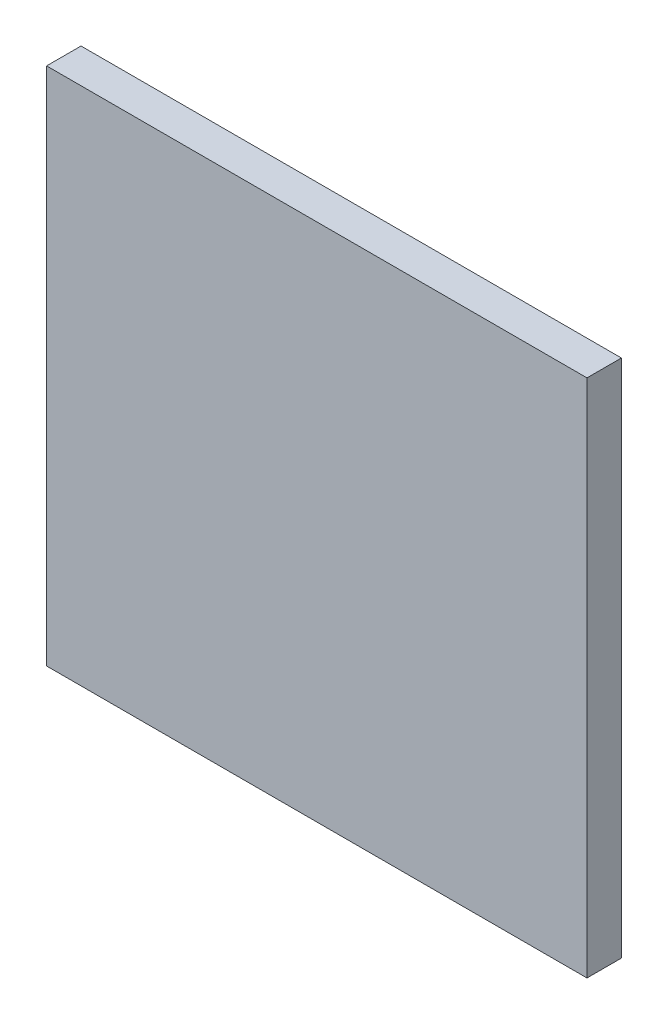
from build123d import *

# Parameters (mm, degrees)
ESQUISSE1_W        = 157
ESQUISSE1_H        = 151
BOSS_EXTRU_1_DEPTH = 10


with BuildPart() as part:
    # Esquisse1 → Boss.-Extru.1 (new body)
    with BuildSketch(Plane.XY):
        with Locations((32.805627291, -38.395939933)):
            Rectangle(ESQUISSE1_W, ESQUISSE1_H)
    extrude(amount=BOSS_EXTRU_1_DEPTH)


solid = part.part
